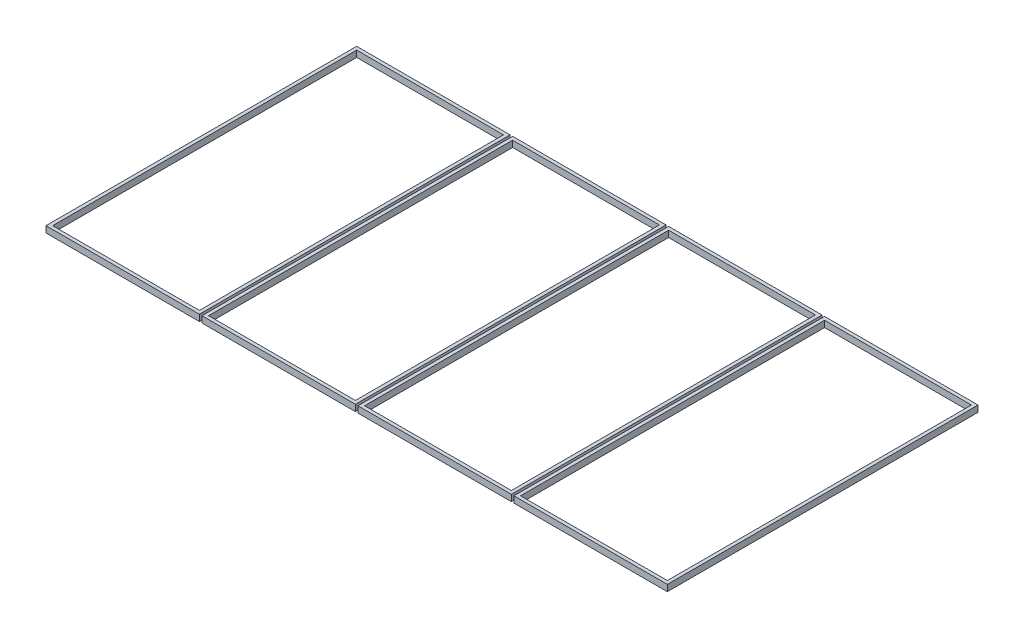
from build123d import *

# Parameters (mm, degrees)
SKETCH1_W            = 576.5
SKETCH1_H            = 1194
BOSS_EXTRU_1_DEPTH   = 25
BOSS_EXTRU_1_2_DEPTH = 25
BOSS_EXTRU_1_3_DEPTH = 25
BOSS_EXTRU_1_4_DEPTH = 25


with BuildPart() as part:
    # Sketch1 → Boss.-Extru.1 (new body)
    with BuildSketch(Plane(origin=(0, 0, 0), x_dir=(1, 0, 0), z_dir=(0, 1, 0))):
        Polygon((0, 0), (0, 1220), (602.5, 1220), (602.5, 0), (589.5, 0), (13, 0), align=None)
        with Locations((301.25, 610)):
            Rectangle(SKETCH1_W, SKETCH1_H, mode=Mode.SUBTRACT)
    extrude(amount=BOSS_EXTRU_1_DEPTH)


with BuildPart() as body_2:
    # Sketch1 → Boss.-Extru.1 2 (new body)
    with BuildSketch(Plane(origin=(0, 0, 0), x_dir=(1, 0, 0), z_dir=(0, 1, 0))):
        Polygon((2440, 0), (2440, 1220), (1837.5, 1220), (1837.5, 0), (1850.5, 0), (2427, 0), align=None)
        with Locations((2138.75, 610)):
            Rectangle(SKETCH1_W, SKETCH1_H, mode=Mode.SUBTRACT)
    extrude(amount=BOSS_EXTRU_1_2_DEPTH)


with BuildPart() as body_3:
    # Sketch1 → Boss.-Extru.1 3 (new body)
    with BuildSketch(Plane(origin=(0, 0, 0), x_dir=(1, 0, 0), z_dir=(0, 1, 0))):
        Polygon((625.5, 0), (1202, 0), (1215, 0), (1215, 1220), (612.5, 1220), (612.5, 0), align=None)
        with Locations((913.75, 610)):
            Rectangle(SKETCH1_W, SKETCH1_H, mode=Mode.SUBTRACT)
    extrude(amount=BOSS_EXTRU_1_3_DEPTH)


with BuildPart() as body_4:
    # Sketch1 → Boss.-Extru.1 4 (new body)
    with BuildSketch(Plane(origin=(0, 0, 0), x_dir=(1, 0, 0), z_dir=(0, 1, 0))):
        Polygon((1238, 0), (1814.5, 0), (1827.5, 0), (1827.5, 1220), (1225, 1220), (1225, 0), align=None)
        with Locations((1526.25, 610)):
            Rectangle(SKETCH1_W, SKETCH1_H, mode=Mode.SUBTRACT)
    extrude(amount=BOSS_EXTRU_1_4_DEPTH)


solid = Compound([part.part, body_2.part, body_3.part, body_4.part])
